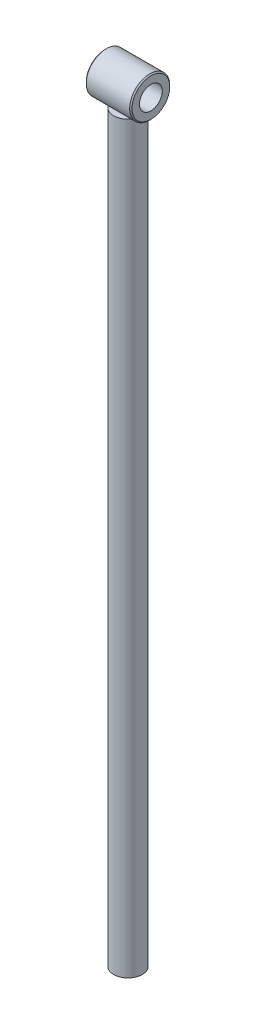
ISO-10303-21;
HEADER;
FILE_DESCRIPTION(('STEP AP214'),'2;1');
FILE_NAME('part.step','',(''),(''),'','','');
FILE_SCHEMA(('AUTOMOTIVE_DESIGN { 1 0 10303 214 1 1 1 1 }'));
ENDSEC;
DATA;
#1=APPLICATION_CONTEXT('core data for automotive mechanical design processes');
#2=APPLICATION_PROTOCOL_DEFINITION('international standard','automotive_design',2000,#1);
#3=PRODUCT_CONTEXT('',#1,'mechanical');
#4=PRODUCT('Part','Part','',(#3));
#5=PRODUCT_RELATED_PRODUCT_CATEGORY('part','',(#4));
#6=PRODUCT_DEFINITION_FORMATION('','',#4);
#7=PRODUCT_DEFINITION_CONTEXT('part definition',#1,'design');
#8=PRODUCT_DEFINITION('design','',#6,#7);
#9=PRODUCT_DEFINITION_SHAPE('','',#8);
#10=(LENGTH_UNIT() NAMED_UNIT(*) SI_UNIT(.MILLI.,.METRE.));
#11=(NAMED_UNIT(*) PLANE_ANGLE_UNIT() SI_UNIT($,.RADIAN.));
#12=(NAMED_UNIT(*) SI_UNIT($,.STERADIAN.) SOLID_ANGLE_UNIT());
#13=UNCERTAINTY_MEASURE_WITH_UNIT(LENGTH_MEASURE(1.E-05),#10,'distance_accuracy_value','');
#14=(GEOMETRIC_REPRESENTATION_CONTEXT(3) GLOBAL_UNCERTAINTY_ASSIGNED_CONTEXT((#13)) GLOBAL_UNIT_ASSIGNED_CONTEXT((#10,
#11,#12)) REPRESENTATION_CONTEXT('',''));
#15=CARTESIAN_POINT('',(0.,0.,0.));
#16=DIRECTION('',(0.,0.,1.));
#17=DIRECTION('',(1.,0.,0.));
#18=AXIS2_PLACEMENT_3D('',#15,#16,#17);
#19=CARTESIAN_POINT('',(20.,667.499999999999,-3.33066907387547E-13));
#20=DIRECTION('',(1.,0.,0.));
#21=DIRECTION('',(0.,0.,-0.999999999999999));
#22=AXIS2_PLACEMENT_3D('',#19,#20,#21);
#23=PLANE('',#22);
#24=CARTESIAN_POINT('',(20.,667.499999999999,-3.33066907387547E-13));
#25=DIRECTION('',(1.,0.,0.));
#26=DIRECTION('',(0.,0.,-0.999999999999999));
#27=AXIS2_PLACEMENT_3D('',#24,#25,#26);
#28=CIRCLE('',#27,16.5);
#29=CARTESIAN_POINT('',(20.,667.499999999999,-16.5000000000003));
#30=VERTEX_POINT('',#29);
#31=EDGE_CURVE('E11',#30,#30,#28,.T.);
#32=ORIENTED_EDGE('',*,*,#31,.T.);
#33=EDGE_LOOP('',(#32));
#34=FACE_BOUND('',#33,.T.);
#35=CARTESIAN_POINT('',(20.,667.499999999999,-3.33066907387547E-13));
#36=DIRECTION('',(1.,0.,0.));
#37=DIRECTION('',(0.,0.,-0.999999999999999));
#38=AXIS2_PLACEMENT_3D('',#35,#36,#37);
#39=CIRCLE('',#38,10.);
#40=CARTESIAN_POINT('',(20.,667.499999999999,-10.0000000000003));
#41=VERTEX_POINT('',#40);
#42=EDGE_CURVE('E58',#41,#41,#39,.T.);
#43=ORIENTED_EDGE('',*,*,#42,.F.);
#44=EDGE_LOOP('',(#43));
#45=FACE_BOUND('',#44,.T.);
#46=ADVANCED_FACE('F38',(#34,#45),#23,.T.);
#47=CARTESIAN_POINT('',(-19.9999999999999,667.499999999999,-3.33066907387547E-13));
#48=DIRECTION('',(1.,0.,0.));
#49=DIRECTION('',(0.,0.,-0.999999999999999));
#50=AXIS2_PLACEMENT_3D('',#47,#48,#49);
#51=PLANE('',#50);
#52=CARTESIAN_POINT('',(-19.9999999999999,667.499999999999,-3.33066907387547E-13));
#53=DIRECTION('',(1.,0.,0.));
#54=DIRECTION('',(0.,0.,-0.999999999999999));
#55=AXIS2_PLACEMENT_3D('',#52,#53,#54);
#56=CIRCLE('',#55,16.5);
#57=CARTESIAN_POINT('',(-19.9999999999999,667.499999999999,-16.5000000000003));
#58=VERTEX_POINT('',#57);
#59=EDGE_CURVE('E45',#58,#58,#56,.F.);
#60=ORIENTED_EDGE('',*,*,#59,.T.);
#61=EDGE_LOOP('',(#60));
#62=FACE_BOUND('',#61,.T.);
#63=CARTESIAN_POINT('',(-19.9999999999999,667.499999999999,-3.33066907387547E-13));
#64=DIRECTION('',(1.,0.,0.));
#65=DIRECTION('',(0.,0.,-0.999999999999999));
#66=AXIS2_PLACEMENT_3D('',#63,#64,#65);
#67=CIRCLE('',#66,10.);
#68=CARTESIAN_POINT('',(-19.9999999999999,667.499999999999,-10.0000000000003));
#69=VERTEX_POINT('',#68);
#70=EDGE_CURVE('E59',#69,#69,#67,.T.);
#71=ORIENTED_EDGE('',*,*,#70,.T.);
#72=EDGE_LOOP('',(#71));
#73=FACE_BOUND('',#72,.T.);
#74=ADVANCED_FACE('F69',(#62,#73),#51,.F.);
#75=CARTESIAN_POINT('',(20.,667.499999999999,-3.33066907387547E-13));
#76=DIRECTION('',(-1.,0.,0.));
#77=DIRECTION('',(0.,0.,0.999999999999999));
#78=AXIS2_PLACEMENT_3D('',#75,#76,#77);
#79=CYLINDRICAL_SURFACE('',#78,17.5);
#80=CARTESIAN_POINT('',(-18.9999999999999,667.499999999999,-3.33066907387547E-13));
#81=DIRECTION('',(1.,0.,0.));
#82=DIRECTION('',(0.,0.,-0.999999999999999));
#83=AXIS2_PLACEMENT_3D('',#80,#81,#82);
#84=CIRCLE('',#83,17.5);
#85=CARTESIAN_POINT('',(-18.9999999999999,667.499999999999,-17.5000000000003));
#86=VERTEX_POINT('',#85);
#87=EDGE_CURVE('E49',#86,#86,#84,.T.);
#88=ORIENTED_EDGE('',*,*,#87,.T.);
#89=EDGE_LOOP('',(#88));
#90=FACE_BOUND('',#89,.T.);
#91=CARTESIAN_POINT('',(19.,667.499999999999,-3.33066907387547E-13));
#92=DIRECTION('',(1.,0.,0.));
#93=DIRECTION('',(0.,0.,-0.999999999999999));
#94=AXIS2_PLACEMENT_3D('',#91,#92,#93);
#95=CIRCLE('',#94,17.5);
#96=CARTESIAN_POINT('',(19.,667.499999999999,-17.5000000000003));
#97=VERTEX_POINT('',#96);
#98=EDGE_CURVE('E53',#97,#97,#95,.F.);
#99=ORIENTED_EDGE('',*,*,#98,.T.);
#100=EDGE_LOOP('',(#99));
#101=FACE_BOUND('',#100,.T.);
#102=ADVANCED_FACE('F74',(#90,#101),#79,.T.);
#103=CARTESIAN_POINT('',(20.,667.499999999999,-3.33066907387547E-13));
#104=DIRECTION('',(-1.,0.,0.));
#105=DIRECTION('',(0.,0.,0.999999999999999));
#106=AXIS2_PLACEMENT_3D('',#103,#104,#105);
#107=CYLINDRICAL_SURFACE('',#106,10.);
#108=ORIENTED_EDGE('',*,*,#42,.T.);
#109=EDGE_LOOP('',(#108));
#110=FACE_BOUND('',#109,.T.);
#111=ORIENTED_EDGE('',*,*,#70,.F.);
#112=EDGE_LOOP('',(#111));
#113=FACE_BOUND('',#112,.T.);
#114=ADVANCED_FACE('F65',(#110,#113),#107,.F.);
#115=CARTESIAN_POINT('',(-18.9999999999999,667.499999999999,-3.33066907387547E-13));
#116=DIRECTION('',(1.,0.,0.));
#117=DIRECTION('',(0.,0.,-0.999999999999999));
#118=AXIS2_PLACEMENT_3D('',#115,#116,#117);
#119=CONICAL_SURFACE('',#118,17.5,0.785398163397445);
#120=ORIENTED_EDGE('',*,*,#59,.F.);
#121=EDGE_LOOP('',(#120));
#122=FACE_BOUND('',#121,.T.);
#123=ORIENTED_EDGE('',*,*,#87,.F.);
#124=EDGE_LOOP('',(#123));
#125=FACE_BOUND('',#124,.T.);
#126=ADVANCED_FACE('F80',(#122,#125),#119,.T.);
#127=CARTESIAN_POINT('',(20.,667.499999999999,-3.33066907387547E-13));
#128=DIRECTION('',(-1.,0.,0.));
#129=DIRECTION('',(0.,0.,0.999999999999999));
#130=AXIS2_PLACEMENT_3D('',#127,#128,#129);
#131=CONICAL_SURFACE('',#130,16.5,0.785398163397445);
#132=ORIENTED_EDGE('',*,*,#98,.F.);
#133=EDGE_LOOP('',(#132));
#134=FACE_BOUND('',#133,.T.);
#135=ORIENTED_EDGE('',*,*,#31,.F.);
#136=EDGE_LOOP('',(#135));
#137=FACE_BOUND('',#136,.T.);
#138=ADVANCED_FACE('F40',(#134,#137),#131,.T.);
#139=CLOSED_SHELL('',(#46,#74,#102,#114,#126,#138));
#140=MANIFOLD_SOLID_BREP('B2',#139);
#141=CARTESIAN_POINT('',(0.,649.999999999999,-1.11022302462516E-13));
#142=DIRECTION('',(0.,-0.999999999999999,0.));
#143=DIRECTION('',(0.,0.,-0.999999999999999));
#144=AXIS2_PLACEMENT_3D('',#141,#142,#143);
#145=CYLINDRICAL_SURFACE('',#144,12.5);
#146=CARTESIAN_POINT('',(0.,649.999999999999,-1.11022302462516E-13));
#147=DIRECTION('',(0.,0.999999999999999,0.));
#148=DIRECTION('',(0.,0.,0.999999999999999));
#149=AXIS2_PLACEMENT_3D('',#146,#147,#148);
#150=CIRCLE('',#149,12.5);
#151=CARTESIAN_POINT('',(0.,649.999999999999,-12.5000000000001));
#152=VERTEX_POINT('',#151);
#153=EDGE_CURVE('E37',#152,#152,#150,.T.);
#154=CARTESIAN_POINT('',(0.,0.,0.));
#155=DIRECTION('',(0.,0.999999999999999,0.));
#156=DIRECTION('',(0.,0.,0.999999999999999));
#157=AXIS2_PLACEMENT_3D('',#154,#155,#156);
#158=CIRCLE('',#157,12.5);
#159=CARTESIAN_POINT('',(0.,-1.11022302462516E-13,-12.5000000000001));
#160=VERTEX_POINT('',#159);
#161=EDGE_CURVE('E120',#160,#160,#158,.T.);
#162=CARTESIAN_POINT('',(0.,649.999999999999,-12.5000000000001));
#163=CARTESIAN_POINT('',(0.,643.229166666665,-12.5000000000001));
#164=CARTESIAN_POINT('',(0.,636.458333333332,-12.5000000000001));
#165=CARTESIAN_POINT('',(0.,622.916666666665,-12.5000000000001));
#166=CARTESIAN_POINT('',(0.,616.145833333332,-12.5000000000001));
#167=CARTESIAN_POINT('',(0.,602.604166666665,-12.5000000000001));
#168=CARTESIAN_POINT('',(0.,595.833333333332,-12.5000000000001));
#169=CARTESIAN_POINT('',(0.,582.291666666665,-12.5000000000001));
#170=CARTESIAN_POINT('',(0.,575.520833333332,-12.5000000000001));
#171=CARTESIAN_POINT('',(0.,561.979166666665,-12.5000000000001));
#172=CARTESIAN_POINT('',(0.,555.208333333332,-12.5000000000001));
#173=CARTESIAN_POINT('',(0.,541.666666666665,-12.5000000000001));
#174=CARTESIAN_POINT('',(0.,534.895833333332,-12.5000000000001));
#175=CARTESIAN_POINT('',(0.,521.354166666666,-12.5000000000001));
#176=CARTESIAN_POINT('',(0.,514.583333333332,-12.5000000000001));
#177=CARTESIAN_POINT('',(0.,501.041666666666,-12.5000000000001));
#178=CARTESIAN_POINT('',(0.,494.270833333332,-12.5000000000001));
#179=CARTESIAN_POINT('',(0.,480.729166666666,-12.5000000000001));
#180=CARTESIAN_POINT('',(0.,473.958333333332,-12.5000000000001));
#181=CARTESIAN_POINT('',(0.,460.416666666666,-12.5000000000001));
#182=CARTESIAN_POINT('',(0.,453.645833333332,-12.5000000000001));
#183=CARTESIAN_POINT('',(0.,440.104166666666,-12.5000000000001));
#184=CARTESIAN_POINT('',(0.,433.333333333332,-12.5000000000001));
#185=CARTESIAN_POINT('',(0.,419.791666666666,-12.5000000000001));
#186=CARTESIAN_POINT('',(0.,413.020833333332,-12.5000000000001));
#187=CARTESIAN_POINT('',(0.,399.479166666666,-12.5000000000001));
#188=CARTESIAN_POINT('',(0.,392.708333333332,-12.5000000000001));
#189=CARTESIAN_POINT('',(0.,379.166666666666,-12.5000000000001));
#190=CARTESIAN_POINT('',(0.,372.395833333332,-12.5000000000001));
#191=CARTESIAN_POINT('',(0.,358.854166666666,-12.5000000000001));
#192=CARTESIAN_POINT('',(0.,352.083333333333,-12.5000000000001));
#193=CARTESIAN_POINT('',(0.,338.541666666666,-12.5000000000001));
#194=CARTESIAN_POINT('',(0.,331.770833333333,-12.5000000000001));
#195=CARTESIAN_POINT('',(0.,318.229166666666,-12.5000000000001));
#196=CARTESIAN_POINT('',(0.,311.458333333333,-12.5000000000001));
#197=CARTESIAN_POINT('',(0.,297.916666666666,-12.5000000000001));
#198=CARTESIAN_POINT('',(0.,291.145833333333,-12.5000000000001));
#199=CARTESIAN_POINT('',(0.,277.604166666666,-12.5000000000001));
#200=CARTESIAN_POINT('',(0.,270.833333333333,-12.5000000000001));
#201=CARTESIAN_POINT('',(0.,257.291666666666,-12.5000000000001));
#202=CARTESIAN_POINT('',(0.,250.520833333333,-12.5000000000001));
#203=CARTESIAN_POINT('',(0.,236.979166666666,-12.5000000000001));
#204=CARTESIAN_POINT('',(0.,230.208333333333,-12.5000000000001));
#205=CARTESIAN_POINT('',(0.,216.666666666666,-12.5000000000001));
#206=CARTESIAN_POINT('',(0.,209.895833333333,-12.5000000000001));
#207=CARTESIAN_POINT('',(0.,196.354166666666,-12.5000000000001));
#208=CARTESIAN_POINT('',(0.,189.583333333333,-12.5000000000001));
#209=CARTESIAN_POINT('',(0.,176.041666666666,-12.5000000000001));
#210=CARTESIAN_POINT('',(0.,169.270833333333,-12.5000000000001));
#211=CARTESIAN_POINT('',(0.,155.729166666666,-12.5000000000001));
#212=CARTESIAN_POINT('',(0.,148.958333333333,-12.5000000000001));
#213=CARTESIAN_POINT('',(0.,135.416666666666,-12.5000000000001));
#214=CARTESIAN_POINT('',(0.,128.645833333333,-12.5000000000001));
#215=CARTESIAN_POINT('',(0.,115.104166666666,-12.5000000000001));
#216=CARTESIAN_POINT('',(0.,108.333333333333,-12.5000000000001));
#217=CARTESIAN_POINT('',(0.,94.7916666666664,-12.5000000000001));
#218=CARTESIAN_POINT('',(0.,88.0208333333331,-12.5000000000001));
#219=CARTESIAN_POINT('',(0.,74.4791666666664,-12.5000000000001));
#220=CARTESIAN_POINT('',(0.,67.7083333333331,-12.5000000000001));
#221=CARTESIAN_POINT('',(0.,54.1666666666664,-12.5000000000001));
#222=CARTESIAN_POINT('',(0.,47.3958333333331,-12.5000000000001));
#223=CARTESIAN_POINT('',(0.,33.8541666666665,-12.5000000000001));
#224=CARTESIAN_POINT('',(0.,27.0833333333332,-12.5000000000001));
#225=CARTESIAN_POINT('',(0.,13.5416666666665,-12.5000000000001));
#226=CARTESIAN_POINT('',(0.,6.77083333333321,-12.5000000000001));
#227=CARTESIAN_POINT('',(0.,-1.11022302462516E-13,-12.5000000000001));
#228=B_SPLINE_CURVE_WITH_KNOTS('',3,(#162,#163,#164,#165,#166,#167,#168,#169,#170,#171,#172,
#173,#174,#175,#176,#177,#178,#179,#180,#181,#182,#183,#184,#185,#186,#187,#188,#189,#190,#191,
#192,#193,#194,#195,#196,#197,#198,#199,#200,#201,#202,#203,#204,#205,#206,#207,#208,#209,#210,
#211,#212,#213,#214,#215,#216,#217,#218,#219,#220,#221,#222,#223,#224,#225,#226,#227),
.UNSPECIFIED.,.F.,.F.,(4,2,2,2,2,2,2,2,2,2,2,2,2,2,2,2,2,2,2,2,2,2,2,2,2,2,2,2,2,2,2,2,4),(0.,
20.3125000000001,40.625,60.9375,81.2499999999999,101.5625,121.875,142.1875,162.5,182.8125,
203.125,223.4375,243.75,264.0625,284.375,304.687499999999,324.999999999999,345.312499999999,
365.624999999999,385.937499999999,406.249999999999,426.562499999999,446.874999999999,
467.187499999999,487.499999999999,507.812499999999,528.124999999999,548.437499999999,
568.749999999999,589.062499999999,609.374999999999,629.687499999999,649.999999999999),.UNSPECIFIED.);
#229=EDGE_CURVE('BSEAM117',#152,#160,#228,.T.);
#230=ORIENTED_EDGE('',*,*,#153,.F.);
#231=ORIENTED_EDGE('',*,*,#161,.T.);
#232=ORIENTED_EDGE('',*,*,#229,.T.);
#233=ORIENTED_EDGE('',*,*,#229,.F.);
#234=EDGE_LOOP('',(#230,#232,#231,#233));
#235=FACE_BOUND('',#234,.T.);
#236=ADVANCED_FACE('F117',(#235),#145,.T.);
#237=CARTESIAN_POINT('',(0.,649.999999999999,-1.11022302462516E-13));
#238=DIRECTION('',(0.,0.999999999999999,0.));
#239=DIRECTION('',(0.,0.,0.999999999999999));
#240=AXIS2_PLACEMENT_3D('',#237,#238,#239);
#241=PLANE('',#240);
#242=ORIENTED_EDGE('',*,*,#153,.T.);
#243=EDGE_LOOP('',(#242));
#244=FACE_BOUND('',#243,.T.);
#245=ADVANCED_FACE('F132',(#244),#241,.T.);
#246=CARTESIAN_POINT('',(0.,0.,0.));
#247=DIRECTION('',(0.,0.999999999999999,0.));
#248=DIRECTION('',(0.,0.,0.999999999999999));
#249=AXIS2_PLACEMENT_3D('',#246,#247,#248);
#250=PLANE('',#249);
#251=ORIENTED_EDGE('',*,*,#161,.F.);
#252=EDGE_LOOP('',(#251));
#253=FACE_BOUND('',#252,.T.);
#254=ADVANCED_FACE('F130',(#253),#250,.F.);
#255=CLOSED_SHELL('',(#236,#245,#254));
#256=MANIFOLD_SOLID_BREP('B6',#255);
#257=ADVANCED_BREP_SHAPE_REPRESENTATION('',(#18,#140,#256),#14);
#258=SHAPE_DEFINITION_REPRESENTATION(#9,#257);
ENDSEC;
END-ISO-10303-21;
